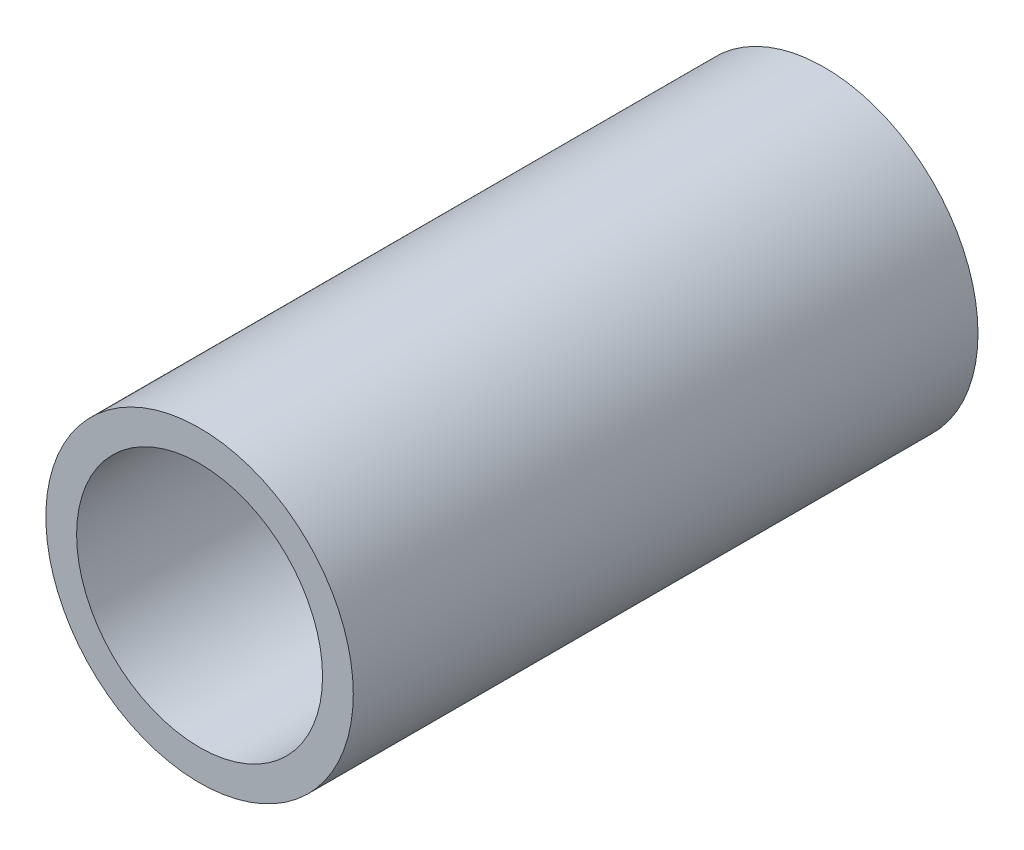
ISO-10303-21;
HEADER;
FILE_DESCRIPTION(('STEP AP214'),'2;1');
FILE_NAME('part.step','',(''),(''),'','','');
FILE_SCHEMA(('AUTOMOTIVE_DESIGN { 1 0 10303 214 1 1 1 1 }'));
ENDSEC;
DATA;
#1=APPLICATION_CONTEXT('core data for automotive mechanical design processes');
#2=APPLICATION_PROTOCOL_DEFINITION('international standard','automotive_design',2000,#1);
#3=PRODUCT_CONTEXT('',#1,'mechanical');
#4=PRODUCT('Part','Part','',(#3));
#5=PRODUCT_RELATED_PRODUCT_CATEGORY('part','',(#4));
#6=PRODUCT_DEFINITION_FORMATION('','',#4);
#7=PRODUCT_DEFINITION_CONTEXT('part definition',#1,'design');
#8=PRODUCT_DEFINITION('design','',#6,#7);
#9=PRODUCT_DEFINITION_SHAPE('','',#8);
#10=(LENGTH_UNIT() NAMED_UNIT(*) SI_UNIT(.MILLI.,.METRE.));
#11=(NAMED_UNIT(*) PLANE_ANGLE_UNIT() SI_UNIT($,.RADIAN.));
#12=(NAMED_UNIT(*) SI_UNIT($,.STERADIAN.) SOLID_ANGLE_UNIT());
#13=UNCERTAINTY_MEASURE_WITH_UNIT(LENGTH_MEASURE(1.E-05),#10,'distance_accuracy_value','');
#14=(GEOMETRIC_REPRESENTATION_CONTEXT(3) GLOBAL_UNCERTAINTY_ASSIGNED_CONTEXT((#13)) GLOBAL_UNIT_ASSIGNED_CONTEXT((#10,
#11,#12)) REPRESENTATION_CONTEXT('',''));
#15=CARTESIAN_POINT('',(0.,0.,0.));
#16=DIRECTION('',(0.,0.,1.));
#17=DIRECTION('',(1.,0.,0.));
#18=AXIS2_PLACEMENT_3D('',#15,#16,#17);
#19=CARTESIAN_POINT('',(0.,0.,25.4));
#20=DIRECTION('',(0.,0.,1.));
#21=DIRECTION('',(1.,0.,0.));
#22=AXIS2_PLACEMENT_3D('',#19,#20,#21);
#23=PLANE('',#22);
#24=CARTESIAN_POINT('',(0.,0.,25.4));
#25=DIRECTION('',(0.,0.,1.));
#26=DIRECTION('',(1.,0.,0.));
#27=AXIS2_PLACEMENT_3D('',#24,#25,#26);
#28=CIRCLE('',#27,6.25);
#29=CARTESIAN_POINT('',(6.25,0.,25.4));
#30=VERTEX_POINT('',#29);
#31=EDGE_CURVE('E10',#30,#30,#28,.T.);
#32=ORIENTED_EDGE('',*,*,#31,.T.);
#33=EDGE_LOOP('',(#32));
#34=FACE_BOUND('',#33,.T.);
#35=CARTESIAN_POINT('',(0.,0.,25.4));
#36=DIRECTION('',(0.,0.,1.));
#37=DIRECTION('',(1.,0.,0.));
#38=AXIS2_PLACEMENT_3D('',#35,#36,#37);
#39=CIRCLE('',#38,5.);
#40=CARTESIAN_POINT('',(5.,0.,25.4));
#41=VERTEX_POINT('',#40);
#42=EDGE_CURVE('E56',#41,#41,#39,.T.);
#43=ORIENTED_EDGE('',*,*,#42,.F.);
#44=EDGE_LOOP('',(#43));
#45=FACE_BOUND('',#44,.T.);
#46=ADVANCED_FACE('F43',(#34,#45),#23,.T.);
#47=CARTESIAN_POINT('',(0.,0.,0.));
#48=DIRECTION('',(0.,0.,1.));
#49=DIRECTION('',(1.,0.,0.));
#50=AXIS2_PLACEMENT_3D('',#47,#48,#49);
#51=PLANE('',#50);
#52=CARTESIAN_POINT('',(0.,0.,0.));
#53=DIRECTION('',(0.,0.,1.));
#54=DIRECTION('',(1.,0.,0.));
#55=AXIS2_PLACEMENT_3D('',#52,#53,#54);
#56=CIRCLE('',#55,6.25);
#57=CARTESIAN_POINT('',(6.25,0.,0.));
#58=VERTEX_POINT('',#57);
#59=EDGE_CURVE('E47',#58,#58,#56,.T.);
#60=ORIENTED_EDGE('',*,*,#59,.F.);
#61=EDGE_LOOP('',(#60));
#62=FACE_BOUND('',#61,.T.);
#63=CARTESIAN_POINT('',(0.,0.,0.));
#64=DIRECTION('',(0.,0.,1.));
#65=DIRECTION('',(1.,0.,0.));
#66=AXIS2_PLACEMENT_3D('',#63,#64,#65);
#67=CIRCLE('',#66,5.);
#68=CARTESIAN_POINT('',(5.,0.,0.));
#69=VERTEX_POINT('',#68);
#70=EDGE_CURVE('E58',#69,#69,#67,.T.);
#71=ORIENTED_EDGE('',*,*,#70,.T.);
#72=EDGE_LOOP('',(#71));
#73=FACE_BOUND('',#72,.T.);
#74=ADVANCED_FACE('F70',(#62,#73),#51,.F.);
#75=CARTESIAN_POINT('',(0.,0.,25.4));
#76=DIRECTION('',(0.,0.,-1.));
#77=DIRECTION('',(-1.,0.,0.));
#78=AXIS2_PLACEMENT_3D('',#75,#76,#77);
#79=CYLINDRICAL_SURFACE('',#78,6.25);
#80=ORIENTED_EDGE('',*,*,#31,.F.);
#81=EDGE_LOOP('',(#80));
#82=FACE_BOUND('',#81,.T.);
#83=ORIENTED_EDGE('',*,*,#59,.T.);
#84=EDGE_LOOP('',(#83));
#85=FACE_BOUND('',#84,.T.);
#86=ADVANCED_FACE('F45',(#82,#85),#79,.T.);
#87=CARTESIAN_POINT('',(0.,0.,25.4));
#88=DIRECTION('',(0.,0.,-1.));
#89=DIRECTION('',(-1.,0.,0.));
#90=AXIS2_PLACEMENT_3D('',#87,#88,#89);
#91=CYLINDRICAL_SURFACE('',#90,5.);
#92=ORIENTED_EDGE('',*,*,#42,.T.);
#93=EDGE_LOOP('',(#92));
#94=FACE_BOUND('',#93,.T.);
#95=ORIENTED_EDGE('',*,*,#70,.F.);
#96=EDGE_LOOP('',(#95));
#97=FACE_BOUND('',#96,.T.);
#98=ADVANCED_FACE('F66',(#94,#97),#91,.F.);
#99=CLOSED_SHELL('',(#46,#74,#86,#98));
#100=MANIFOLD_SOLID_BREP('B2',#99);
#101=ADVANCED_BREP_SHAPE_REPRESENTATION('',(#18,#100),#14);
#102=SHAPE_DEFINITION_REPRESENTATION(#9,#101);
ENDSEC;
END-ISO-10303-21;
